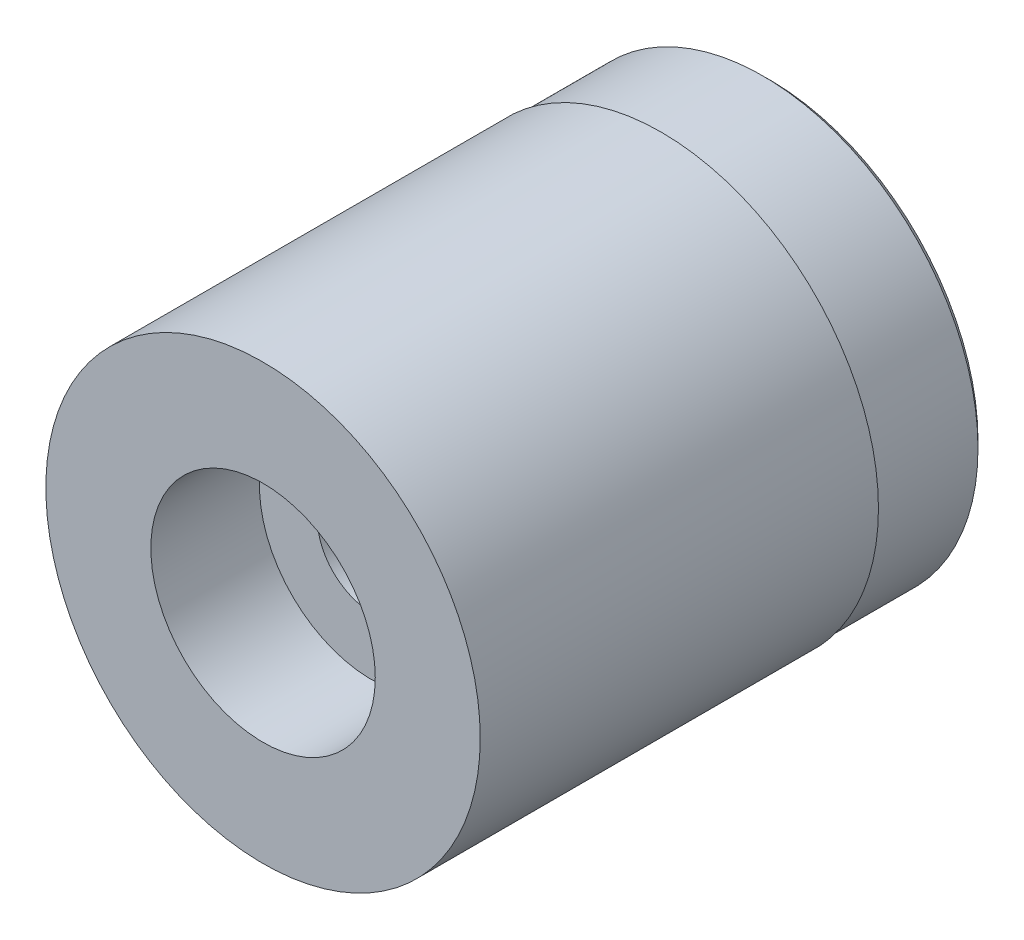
from build123d import *

# Parameters (mm, degrees)
SKETCH4_W = 3
SKETCH4_H = 1


with BuildPart() as part:
    # Sketch1 → Revolve1 (revolve)
    with BuildSketch(Plane(origin=(0, 0, 0), x_dir=(0, 0, -1), z_dir=(1, 0, 0)), mode=Mode.PRIVATE) as revolve1_sk:
        Polygon((0, 6), (0, 3.1), (3, 3.1), (3, 1.5), (14, 1.5), (14, 5.75), (13.75, 6), align=None)
    revolve(revolve1_sk.sketch.rotate(Axis((0, 0, 3.797909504), (0, 0, -1)), 90), axis=Axis((0, 0, 3.797909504), (0, 0, -1)))

    # Sketch4 → Cut-Revolve1 (revolve, cut)
    with BuildSketch(Plane(origin=(0, 0, 0), x_dir=(0, 0, -1), z_dir=(1, 0, 0)), mode=Mode.PRIVATE) as cut_revolve1_sk:
        with Locations((12.5, 6.435)):
            Rectangle(SKETCH4_W, SKETCH4_H)
    revolve(cut_revolve1_sk.sketch.rotate(Axis((0, 0, 0), (0, 0, -1)), 90), axis=Axis((0, 0, 0), (0, 0, -1)), mode=Mode.SUBTRACT)


solid = part.part
